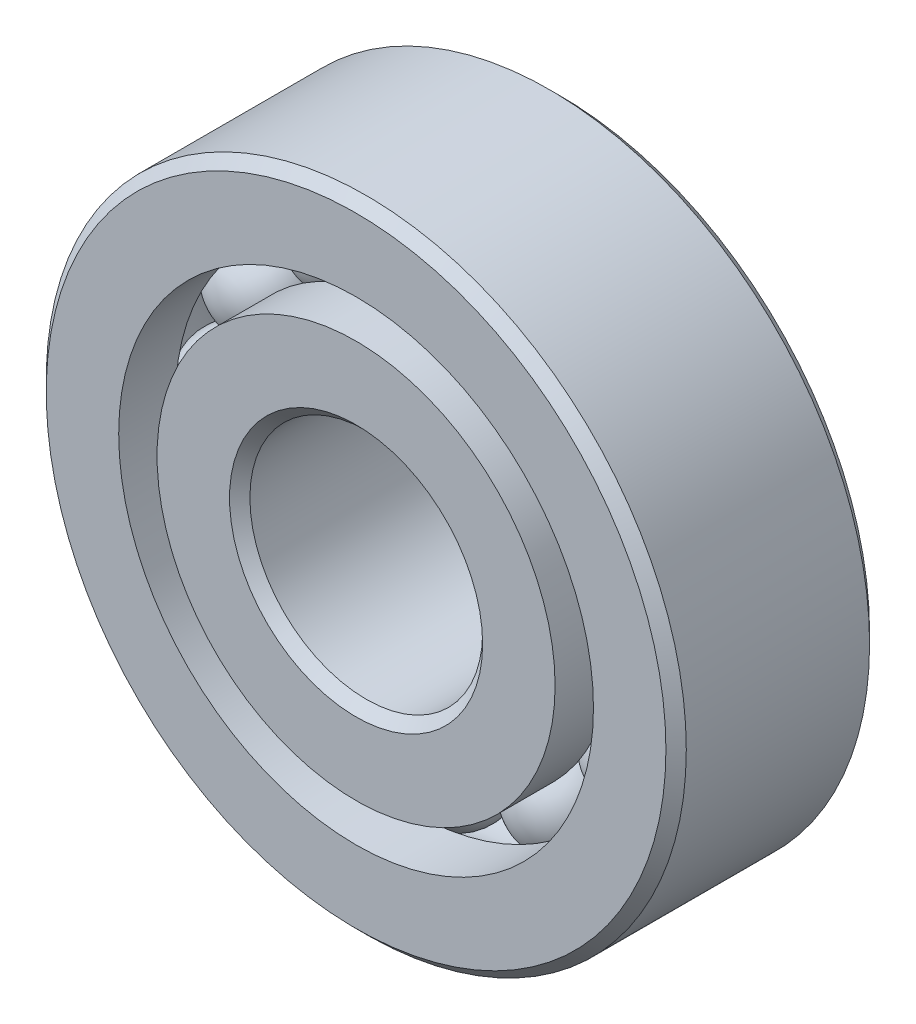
from build123d import *

# Parameters (mm, degrees)
CIRPATTERN1_COUNT = 12


with BuildPart() as part:
    # Sketch1 → Revolve1 (revolve)
    with BuildSketch(Plane(origin=(0, 0, 0), x_dir=(0, 0, -1), z_dir=(1, 0, 0)), mode=Mode.PRIVATE) as revolve1_sk:
        with BuildLine():
            Line((3.15, 11), (-3.15, 11))
            Line((-3.15, 11), (-3.5, 10.65))
            Line((-3.5, 10.65), (-3.5, 8.159340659))
            Line((-3.5, 8.159340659), (-1.555555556, 8.159340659))
            ThreePointArc((-1.555555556, 8.159340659), (0, 9.189521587), (1.555555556, 8.159340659))
            Line((1.555555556, 8.159340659), (3.5, 8.159340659))
            Line((3.5, 8.159340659), (3.5, 10.65))
            Line((3.5, 10.65), (3.15, 11))
        make_face()
    revolve(revolve1_sk.sketch.rotate(Axis((0, 0, 3.5), (0, 0, -1)), 90), axis=Axis((0, 0, 3.5), (0, 0, -1)))


with BuildPart() as body_2:
    # Sketch3 → Revolve3 (revolve)
    with BuildSketch(Plane(origin=(0, 0, 0), x_dir=(0, 0, -1), z_dir=(1, 0, 0)), mode=Mode.PRIVATE) as revolve3_sk:
        with BuildLine():
            Line((-3.5, 6.840659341), (-1.555555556, 6.840659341))
            ThreePointArc((-1.555555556, 6.840659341), (0, 5.810478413), (1.555555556, 6.840659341))
            Line((1.555555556, 6.840659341), (3.5, 6.840659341))
            Line((3.5, 6.840659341), (3.5, 4.35))
            Line((3.5, 4.35), (3.15, 4))
            Line((3.15, 4), (-3.15, 4))
            Line((-3.15, 4), (-3.5, 4.35))
            Line((-3.5, 4.35), (-3.5, 6.840659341))
        make_face()
    revolve(revolve3_sk.sketch.rotate(Axis((0, 0, 3.5), (0, 0, -1)), 90), axis=Axis((0, 0, 3.5), (0, 0, -1)))


with BuildPart() as body_3:
    # Sketch4 → Revolve4 (revolve)
    with BuildSketch(Plane(origin=(0, 0, 0), x_dir=(0, 0, -1), z_dir=(1, 0, 0))):
        with BuildLine():
            Line((-1.689521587, 7.5), (1.689521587, 7.5))
            ThreePointArc((1.689521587, 7.5), (0, 9.189521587), (-1.689521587, 7.5))
        make_face()
    revolve(axis=Axis((0, 7.5, 1.689521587), (0, 0, -1)))


with BuildPart() as cirpattern1_1:
    # CirPattern1: pattern copy
    add(body_3.part.rotate(Axis((0, 0, 0), (0, 0, 1)), 1 * 360 / CIRPATTERN1_COUNT))


with BuildPart() as cirpattern1_2:
    # CirPattern1: pattern copy
    add(body_3.part.rotate(Axis((0, 0, 0), (0, 0, 1)), 2 * 360 / CIRPATTERN1_COUNT))


with BuildPart() as cirpattern1_3:
    # CirPattern1: pattern copy
    add(body_3.part.rotate(Axis((0, 0, 0), (0, 0, 1)), 3 * 360 / CIRPATTERN1_COUNT))


with BuildPart() as cirpattern1_4:
    # CirPattern1: pattern copy
    add(body_3.part.rotate(Axis((0, 0, 0), (0, 0, 1)), 4 * 360 / CIRPATTERN1_COUNT))


with BuildPart() as cirpattern1_5:
    # CirPattern1: pattern copy
    add(body_3.part.rotate(Axis((0, 0, 0), (0, 0, 1)), 5 * 360 / CIRPATTERN1_COUNT))


with BuildPart() as cirpattern1_6:
    # CirPattern1: pattern copy
    add(body_3.part.rotate(Axis((0, 0, 0), (0, 0, 1)), 6 * 360 / CIRPATTERN1_COUNT))


with BuildPart() as cirpattern1_7:
    # CirPattern1: pattern copy
    add(body_3.part.rotate(Axis((0, 0, 0), (0, 0, 1)), 7 * 360 / CIRPATTERN1_COUNT))


with BuildPart() as cirpattern1_8:
    # CirPattern1: pattern copy
    add(body_3.part.rotate(Axis((0, 0, 0), (0, 0, 1)), 8 * 360 / CIRPATTERN1_COUNT))


with BuildPart() as cirpattern1_9:
    # CirPattern1: pattern copy
    add(body_3.part.rotate(Axis((0, 0, 0), (0, 0, 1)), 9 * 360 / CIRPATTERN1_COUNT))


with BuildPart() as cirpattern1_10:
    # CirPattern1: pattern copy
    add(body_3.part.rotate(Axis((0, 0, 0), (0, 0, 1)), 10 * 360 / CIRPATTERN1_COUNT))


with BuildPart() as cirpattern1_11:
    # CirPattern1: pattern copy
    add(body_3.part.rotate(Axis((0, 0, 0), (0, 0, 1)), 11 * 360 / CIRPATTERN1_COUNT))


solid = Compound([part.part, body_2.part, body_3.part, cirpattern1_1.part, cirpattern1_2.part, cirpattern1_3.part, cirpattern1_4.part, cirpattern1_5.part, cirpattern1_6.part, cirpattern1_7.part, cirpattern1_8.part, cirpattern1_9.part, cirpattern1_10.part, cirpattern1_11.part])
